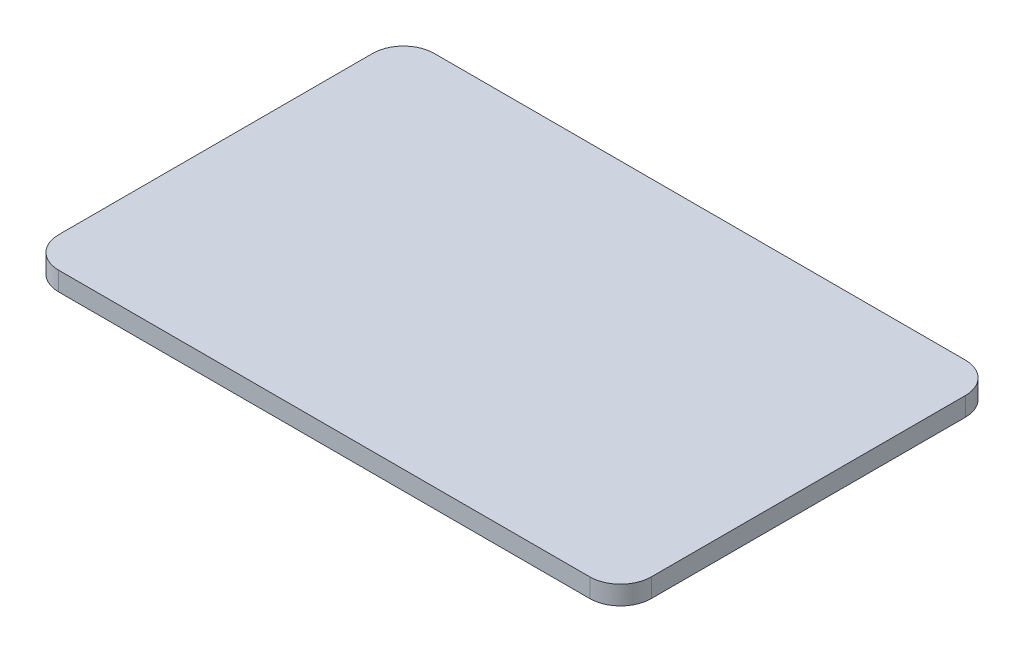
from build123d import *

# Parameters (mm, degrees)
BOSS_EXTRUDE1_DEPTH = 1.84


with BuildPart() as part:
    # Sketch1 → Boss-Extrude1 (new body)
    with BuildSketch(Plane(origin=(0, 0, 0), x_dir=(1, 0, 0), z_dir=(0, 1, 0))):
        with BuildLine():
            Line((3, 0), (54.84, 0))
            ThreePointArc((54.84, 0), (56.961320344, 0.878679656), (57.84, 3))
            Line((57.84, 3), (57.84, 33.65))
            ThreePointArc((57.84, 33.65), (56.961320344, 35.771320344), (54.84, 36.65))
            Line((54.84, 36.65), (3, 36.65))
            ThreePointArc((3, 36.65), (0.878679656, 35.771320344), (0, 33.65))
            Line((0, 33.65), (0, 3))
            ThreePointArc((0, 3), (0.878679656, 0.878679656), (3, 0))
        make_face()
    extrude(amount=BOSS_EXTRUDE1_DEPTH)


solid = part.part
